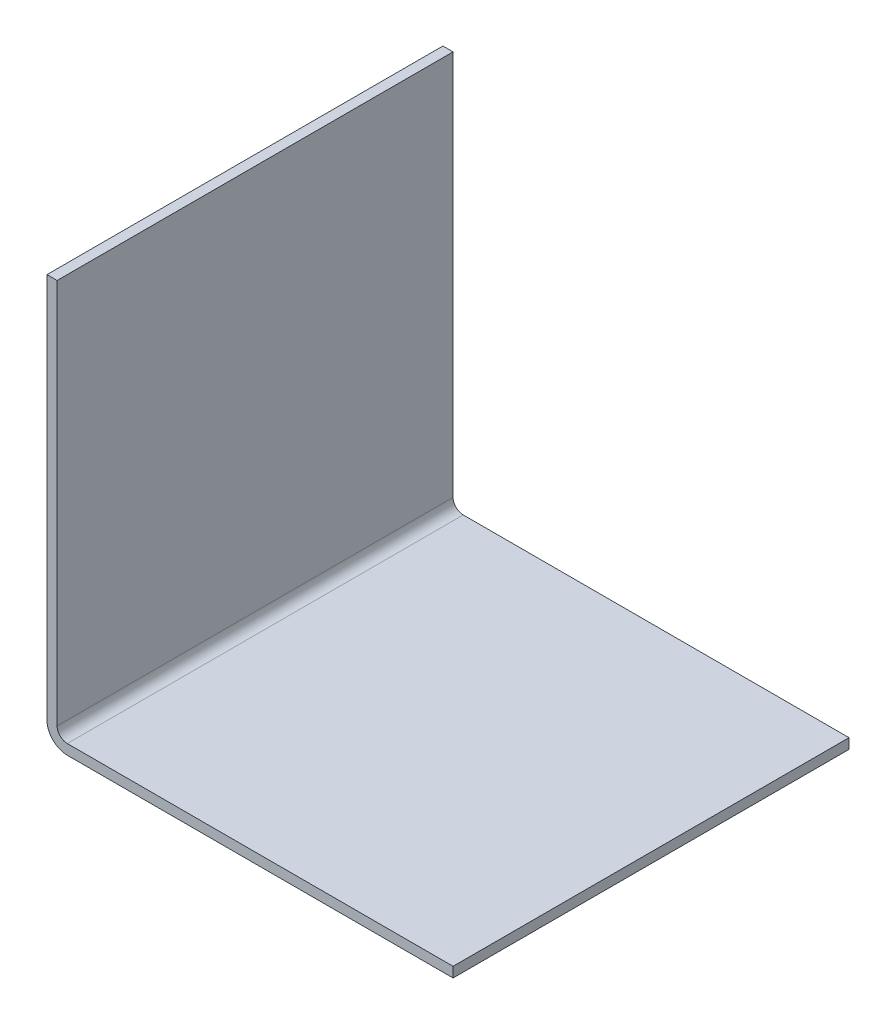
ISO-10303-21;
HEADER;
FILE_DESCRIPTION(('STEP AP214'),'2;1');
FILE_NAME('part.step','',(''),(''),'','','');
FILE_SCHEMA(('AUTOMOTIVE_DESIGN { 1 0 10303 214 1 1 1 1 }'));
ENDSEC;
DATA;
#1=APPLICATION_CONTEXT('core data for automotive mechanical design processes');
#2=APPLICATION_PROTOCOL_DEFINITION('international standard','automotive_design',2000,#1);
#3=PRODUCT_CONTEXT('',#1,'mechanical');
#4=PRODUCT('Part','Part','',(#3));
#5=PRODUCT_RELATED_PRODUCT_CATEGORY('part','',(#4));
#6=PRODUCT_DEFINITION_FORMATION('','',#4);
#7=PRODUCT_DEFINITION_CONTEXT('part definition',#1,'design');
#8=PRODUCT_DEFINITION('design','',#6,#7);
#9=PRODUCT_DEFINITION_SHAPE('','',#8);
#10=(LENGTH_UNIT() NAMED_UNIT(*) SI_UNIT(.MILLI.,.METRE.));
#11=(NAMED_UNIT(*) PLANE_ANGLE_UNIT() SI_UNIT($,.RADIAN.));
#12=(NAMED_UNIT(*) SI_UNIT($,.STERADIAN.) SOLID_ANGLE_UNIT());
#13=UNCERTAINTY_MEASURE_WITH_UNIT(LENGTH_MEASURE(1.E-05),#10,'distance_accuracy_value','');
#14=(GEOMETRIC_REPRESENTATION_CONTEXT(3) GLOBAL_UNCERTAINTY_ASSIGNED_CONTEXT((#13)) GLOBAL_UNIT_ASSIGNED_CONTEXT((#10,
#11,#12)) REPRESENTATION_CONTEXT('',''));
#15=CARTESIAN_POINT('',(0.,0.,0.));
#16=DIRECTION('',(0.,0.,1.));
#17=DIRECTION('',(1.,0.,0.));
#18=AXIS2_PLACEMENT_3D('',#15,#16,#17);
#19=CARTESIAN_POINT('',(40.,0.,39.));
#20=DIRECTION('',(-1.,0.,0.));
#21=DIRECTION('',(0.,0.,1.));
#22=AXIS2_PLACEMENT_3D('',#19,#20,#21);
#23=PLANE('',#22);
#24=DIRECTION('',(0.,1.,0.));
#25=VECTOR('',#24,1.);
#26=CARTESIAN_POINT('',(40.,0.,0.));
#27=LINE('',#26,#25);
#28=CARTESIAN_POINT('',(40.,0.,0.));
#29=VERTEX_POINT('',#28);
#30=CARTESIAN_POINT('',(40.,0.999999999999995,0.));
#31=VERTEX_POINT('',#30);
#32=EDGE_CURVE('E133',#29,#31,#27,.T.);
#33=ORIENTED_EDGE('',*,*,#32,.T.);
#34=DIRECTION('',(0.,0.,-1.));
#35=VECTOR('',#34,1.);
#36=CARTESIAN_POINT('',(40.,0.999999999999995,39.));
#37=LINE('',#36,#35);
#38=CARTESIAN_POINT('',(40.,0.999999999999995,39.));
#39=VERTEX_POINT('',#38);
#40=EDGE_CURVE('E11',#39,#31,#37,.T.);
#41=ORIENTED_EDGE('',*,*,#40,.F.);
#42=DIRECTION('',(0.,1.,0.));
#43=VECTOR('',#42,1.);
#44=CARTESIAN_POINT('',(40.,0.,39.));
#45=LINE('',#44,#43);
#46=CARTESIAN_POINT('',(40.,0.,39.));
#47=VERTEX_POINT('',#46);
#48=EDGE_CURVE('E147',#47,#39,#45,.T.);
#49=ORIENTED_EDGE('',*,*,#48,.F.);
#50=DIRECTION('',(0.,0.,-1.));
#51=VECTOR('',#50,1.);
#52=CARTESIAN_POINT('',(40.,0.,39.));
#53=LINE('',#52,#51);
#54=EDGE_CURVE('E129',#47,#29,#53,.T.);
#55=ORIENTED_EDGE('',*,*,#54,.T.);
#56=EDGE_LOOP('',(#33,#41,#49,#55));
#57=FACE_BOUND('',#56,.T.);
#58=ADVANCED_FACE('F37',(#57),#23,.F.);
#59=CARTESIAN_POINT('',(40.,0.999999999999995,39.));
#60=DIRECTION('',(0.,-1.,0.));
#61=DIRECTION('',(1.,0.,0.));
#62=AXIS2_PLACEMENT_3D('',#59,#60,#61);
#63=PLANE('',#62);
#64=DIRECTION('',(-1.,0.,0.));
#65=VECTOR('',#64,1.);
#66=CARTESIAN_POINT('',(40.,0.999999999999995,0.));
#67=LINE('',#66,#65);
#68=CARTESIAN_POINT('',(2.00000000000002,0.99999999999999,0.));
#69=VERTEX_POINT('',#68);
#70=EDGE_CURVE('E136',#31,#69,#67,.T.);
#71=ORIENTED_EDGE('',*,*,#70,.T.);
#72=DIRECTION('',(0.,0.,-1.));
#73=VECTOR('',#72,1.);
#74=CARTESIAN_POINT('',(2.00000000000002,0.99999999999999,39.));
#75=LINE('',#74,#73);
#76=CARTESIAN_POINT('',(2.00000000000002,0.99999999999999,39.));
#77=VERTEX_POINT('',#76);
#78=EDGE_CURVE('E45',#77,#69,#75,.T.);
#79=ORIENTED_EDGE('',*,*,#78,.F.);
#80=DIRECTION('',(-1.,0.,0.));
#81=VECTOR('',#80,1.);
#82=CARTESIAN_POINT('',(40.,0.999999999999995,39.));
#83=LINE('',#82,#81);
#84=EDGE_CURVE('E96',#39,#77,#83,.T.);
#85=ORIENTED_EDGE('',*,*,#84,.F.);
#86=ORIENTED_EDGE('',*,*,#40,.T.);
#87=EDGE_LOOP('',(#71,#79,#85,#86));
#88=FACE_BOUND('',#87,.T.);
#89=ADVANCED_FACE('F182',(#88),#63,.F.);
#90=CARTESIAN_POINT('',(2.00000000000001,1.99999999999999,39.));
#91=DIRECTION('',(0.,0.,-1.));
#92=DIRECTION('',(-1.,0.,0.));
#93=AXIS2_PLACEMENT_3D('',#90,#91,#92);
#94=CYLINDRICAL_SURFACE('',#93,1.);
#95=CARTESIAN_POINT('',(2.00000000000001,1.99999999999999,0.));
#96=DIRECTION('',(0.,0.,-1.));
#97=DIRECTION('',(-1.,0.,0.));
#98=AXIS2_PLACEMENT_3D('',#95,#96,#97);
#99=CIRCLE('',#98,1.);
#100=CARTESIAN_POINT('',(1.00000000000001,2.,0.));
#101=VERTEX_POINT('',#100);
#102=EDGE_CURVE('E138',#69,#101,#99,.T.);
#103=ORIENTED_EDGE('',*,*,#102,.T.);
#104=DIRECTION('',(0.,0.,-1.));
#105=VECTOR('',#104,1.);
#106=CARTESIAN_POINT('',(1.00000000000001,2.,39.));
#107=LINE('',#106,#105);
#108=CARTESIAN_POINT('',(1.00000000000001,2.,39.));
#109=VERTEX_POINT('',#108);
#110=EDGE_CURVE('E154',#109,#101,#107,.T.);
#111=ORIENTED_EDGE('',*,*,#110,.F.);
#112=CARTESIAN_POINT('',(2.00000000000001,1.99999999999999,39.));
#113=DIRECTION('',(0.,0.,-1.));
#114=DIRECTION('',(-1.,0.,0.));
#115=AXIS2_PLACEMENT_3D('',#112,#113,#114);
#116=CIRCLE('',#115,1.);
#117=EDGE_CURVE('E162',#77,#109,#116,.T.);
#118=ORIENTED_EDGE('',*,*,#117,.F.);
#119=ORIENTED_EDGE('',*,*,#78,.T.);
#120=EDGE_LOOP('',(#103,#111,#118,#119));
#121=FACE_BOUND('',#120,.T.);
#122=ADVANCED_FACE('F160',(#121),#94,.F.);
#123=CARTESIAN_POINT('',(1.00000000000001,2.,39.));
#124=DIRECTION('',(-1.,0.,0.));
#125=DIRECTION('',(0.,-1.,0.));
#126=AXIS2_PLACEMENT_3D('',#123,#124,#125);
#127=PLANE('',#126);
#128=DIRECTION('',(0.,1.,0.));
#129=VECTOR('',#128,1.);
#130=CARTESIAN_POINT('',(1.00000000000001,2.,0.));
#131=LINE('',#130,#129);
#132=CARTESIAN_POINT('',(1.00000000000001,40.,0.));
#133=VERTEX_POINT('',#132);
#134=EDGE_CURVE('E140',#101,#133,#131,.T.);
#135=ORIENTED_EDGE('',*,*,#134,.T.);
#136=DIRECTION('',(0.,0.,-1.));
#137=VECTOR('',#136,1.);
#138=CARTESIAN_POINT('',(1.00000000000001,40.,39.));
#139=LINE('',#138,#137);
#140=CARTESIAN_POINT('',(1.00000000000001,40.,39.));
#141=VERTEX_POINT('',#140);
#142=EDGE_CURVE('E151',#141,#133,#139,.T.);
#143=ORIENTED_EDGE('',*,*,#142,.F.);
#144=DIRECTION('',(0.,1.,0.));
#145=VECTOR('',#144,1.);
#146=CARTESIAN_POINT('',(1.00000000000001,2.,39.));
#147=LINE('',#146,#145);
#148=EDGE_CURVE('E174',#109,#141,#147,.T.);
#149=ORIENTED_EDGE('',*,*,#148,.F.);
#150=ORIENTED_EDGE('',*,*,#110,.T.);
#151=EDGE_LOOP('',(#135,#143,#149,#150));
#152=FACE_BOUND('',#151,.T.);
#153=ADVANCED_FACE('F170',(#152),#127,.F.);
#154=CARTESIAN_POINT('',(1.00000000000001,40.,39.));
#155=DIRECTION('',(0.,-1.,0.));
#156=DIRECTION('',(0.,0.,-1.));
#157=AXIS2_PLACEMENT_3D('',#154,#155,#156);
#158=PLANE('',#157);
#159=DIRECTION('',(-1.,0.,0.));
#160=VECTOR('',#159,1.);
#161=CARTESIAN_POINT('',(1.00000000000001,40.,0.));
#162=LINE('',#161,#160);
#163=CARTESIAN_POINT('',(0.,40.,0.));
#164=VERTEX_POINT('',#163);
#165=EDGE_CURVE('E142',#133,#164,#162,.T.);
#166=ORIENTED_EDGE('',*,*,#165,.T.);
#167=DIRECTION('',(0.,0.,-1.));
#168=VECTOR('',#167,1.);
#169=CARTESIAN_POINT('',(0.,40.,39.));
#170=LINE('',#169,#168);
#171=CARTESIAN_POINT('',(0.,40.,39.));
#172=VERTEX_POINT('',#171);
#173=EDGE_CURVE('E124',#172,#164,#170,.T.);
#174=ORIENTED_EDGE('',*,*,#173,.F.);
#175=DIRECTION('',(-1.,0.,0.));
#176=VECTOR('',#175,1.);
#177=CARTESIAN_POINT('',(1.00000000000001,40.,39.));
#178=LINE('',#177,#176);
#179=EDGE_CURVE('E115',#141,#172,#178,.T.);
#180=ORIENTED_EDGE('',*,*,#179,.F.);
#181=ORIENTED_EDGE('',*,*,#142,.T.);
#182=EDGE_LOOP('',(#166,#174,#180,#181));
#183=FACE_BOUND('',#182,.T.);
#184=ADVANCED_FACE('F173',(#183),#158,.F.);
#185=CARTESIAN_POINT('',(0.,40.,39.));
#186=DIRECTION('',(1.,0.,0.));
#187=DIRECTION('',(0.,1.,0.));
#188=AXIS2_PLACEMENT_3D('',#185,#186,#187);
#189=PLANE('',#188);
#190=DIRECTION('',(0.,-1.,0.));
#191=VECTOR('',#190,1.);
#192=CARTESIAN_POINT('',(0.,40.,0.));
#193=LINE('',#192,#191);
#194=CARTESIAN_POINT('',(0.,2.00000000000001,0.));
#195=VERTEX_POINT('',#194);
#196=EDGE_CURVE('E123',#164,#195,#193,.T.);
#197=ORIENTED_EDGE('',*,*,#196,.T.);
#198=DIRECTION('',(0.,0.,-1.));
#199=VECTOR('',#198,1.);
#200=CARTESIAN_POINT('',(0.,2.00000000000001,39.));
#201=LINE('',#200,#199);
#202=CARTESIAN_POINT('',(0.,2.00000000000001,39.));
#203=VERTEX_POINT('',#202);
#204=EDGE_CURVE('E120',#203,#195,#201,.T.);
#205=ORIENTED_EDGE('',*,*,#204,.F.);
#206=DIRECTION('',(0.,-1.,0.));
#207=VECTOR('',#206,1.);
#208=CARTESIAN_POINT('',(0.,40.,39.));
#209=LINE('',#208,#207);
#210=EDGE_CURVE('E109',#172,#203,#209,.T.);
#211=ORIENTED_EDGE('',*,*,#210,.F.);
#212=ORIENTED_EDGE('',*,*,#173,.T.);
#213=EDGE_LOOP('',(#197,#205,#211,#212));
#214=FACE_BOUND('',#213,.T.);
#215=ADVANCED_FACE('F121',(#214),#189,.F.);
#216=CARTESIAN_POINT('',(2.,2.,39.));
#217=DIRECTION('',(0.,0.,-1.));
#218=DIRECTION('',(-1.,0.,0.));
#219=AXIS2_PLACEMENT_3D('',#216,#217,#218);
#220=CYLINDRICAL_SURFACE('',#219,2.);
#221=CARTESIAN_POINT('',(2.,2.,0.));
#222=DIRECTION('',(0.,0.,1.));
#223=DIRECTION('',(-1.,0.,0.));
#224=AXIS2_PLACEMENT_3D('',#221,#222,#223);
#225=CIRCLE('',#224,2.);
#226=CARTESIAN_POINT('',(2.00000000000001,0.,0.));
#227=VERTEX_POINT('',#226);
#228=EDGE_CURVE('E82',#195,#227,#225,.T.);
#229=ORIENTED_EDGE('',*,*,#228,.T.);
#230=DIRECTION('',(0.,0.,-1.));
#231=VECTOR('',#230,1.);
#232=CARTESIAN_POINT('',(2.00000000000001,0.,39.));
#233=LINE('',#232,#231);
#234=CARTESIAN_POINT('',(2.00000000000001,0.,39.));
#235=VERTEX_POINT('',#234);
#236=EDGE_CURVE('E125',#235,#227,#233,.T.);
#237=ORIENTED_EDGE('',*,*,#236,.F.);
#238=CARTESIAN_POINT('',(2.,2.,39.));
#239=DIRECTION('',(0.,0.,1.));
#240=DIRECTION('',(-1.,0.,0.));
#241=AXIS2_PLACEMENT_3D('',#238,#239,#240);
#242=CIRCLE('',#241,2.);
#243=EDGE_CURVE('E113',#203,#235,#242,.T.);
#244=ORIENTED_EDGE('',*,*,#243,.F.);
#245=ORIENTED_EDGE('',*,*,#204,.T.);
#246=EDGE_LOOP('',(#229,#237,#244,#245));
#247=FACE_BOUND('',#246,.T.);
#248=ADVANCED_FACE('F127',(#247),#220,.T.);
#249=CARTESIAN_POINT('',(2.00000000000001,0.,39.));
#250=DIRECTION('',(0.,1.,0.));
#251=DIRECTION('',(0.,0.,1.));
#252=AXIS2_PLACEMENT_3D('',#249,#250,#251);
#253=PLANE('',#252);
#254=DIRECTION('',(1.,0.,0.));
#255=VECTOR('',#254,1.);
#256=CARTESIAN_POINT('',(2.00000000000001,0.,0.));
#257=LINE('',#256,#255);
#258=EDGE_CURVE('E88',#227,#29,#257,.T.);
#259=ORIENTED_EDGE('',*,*,#258,.T.);
#260=ORIENTED_EDGE('',*,*,#54,.F.);
#261=DIRECTION('',(1.,0.,0.));
#262=VECTOR('',#261,1.);
#263=CARTESIAN_POINT('',(2.00000000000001,0.,39.));
#264=LINE('',#263,#262);
#265=EDGE_CURVE('E53',#235,#47,#264,.T.);
#266=ORIENTED_EDGE('',*,*,#265,.F.);
#267=ORIENTED_EDGE('',*,*,#236,.T.);
#268=EDGE_LOOP('',(#259,#260,#266,#267));
#269=FACE_BOUND('',#268,.T.);
#270=ADVANCED_FACE('F198',(#269),#253,.F.);
#271=CARTESIAN_POINT('',(2.00000000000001,1.99999999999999,39.));
#272=DIRECTION('',(0.,0.,-1.));
#273=DIRECTION('',(-1.,0.,0.));
#274=AXIS2_PLACEMENT_3D('',#271,#272,#273);
#275=PLANE('',#274);
#276=ORIENTED_EDGE('',*,*,#48,.T.);
#277=ORIENTED_EDGE('',*,*,#84,.T.);
#278=ORIENTED_EDGE('',*,*,#117,.T.);
#279=ORIENTED_EDGE('',*,*,#148,.T.);
#280=ORIENTED_EDGE('',*,*,#179,.T.);
#281=ORIENTED_EDGE('',*,*,#210,.T.);
#282=ORIENTED_EDGE('',*,*,#243,.T.);
#283=ORIENTED_EDGE('',*,*,#265,.T.);
#284=EDGE_LOOP('',(#276,#277,#278,#279,#280,#281,#282,#283));
#285=FACE_BOUND('',#284,.T.);
#286=ADVANCED_FACE('F111',(#285),#275,.F.);
#287=CARTESIAN_POINT('',(2.00000000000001,1.99999999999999,0.));
#288=DIRECTION('',(0.,0.,-1.));
#289=DIRECTION('',(-1.,0.,0.));
#290=AXIS2_PLACEMENT_3D('',#287,#288,#289);
#291=PLANE('',#290);
#292=ORIENTED_EDGE('',*,*,#32,.F.);
#293=ORIENTED_EDGE('',*,*,#258,.F.);
#294=ORIENTED_EDGE('',*,*,#228,.F.);
#295=ORIENTED_EDGE('',*,*,#196,.F.);
#296=ORIENTED_EDGE('',*,*,#165,.F.);
#297=ORIENTED_EDGE('',*,*,#134,.F.);
#298=ORIENTED_EDGE('',*,*,#102,.F.);
#299=ORIENTED_EDGE('',*,*,#70,.F.);
#300=EDGE_LOOP('',(#292,#293,#294,#295,#296,#297,#298,#299));
#301=FACE_BOUND('',#300,.T.);
#302=ADVANCED_FACE('F166',(#301),#291,.T.);
#303=CLOSED_SHELL('',(#58,#89,#122,#153,#184,#215,#248,#270,#286,#302));
#304=MANIFOLD_SOLID_BREP('B2',#303);
#305=ADVANCED_BREP_SHAPE_REPRESENTATION('',(#18,#304),#14);
#306=SHAPE_DEFINITION_REPRESENTATION(#9,#305);
ENDSEC;
END-ISO-10303-21;
